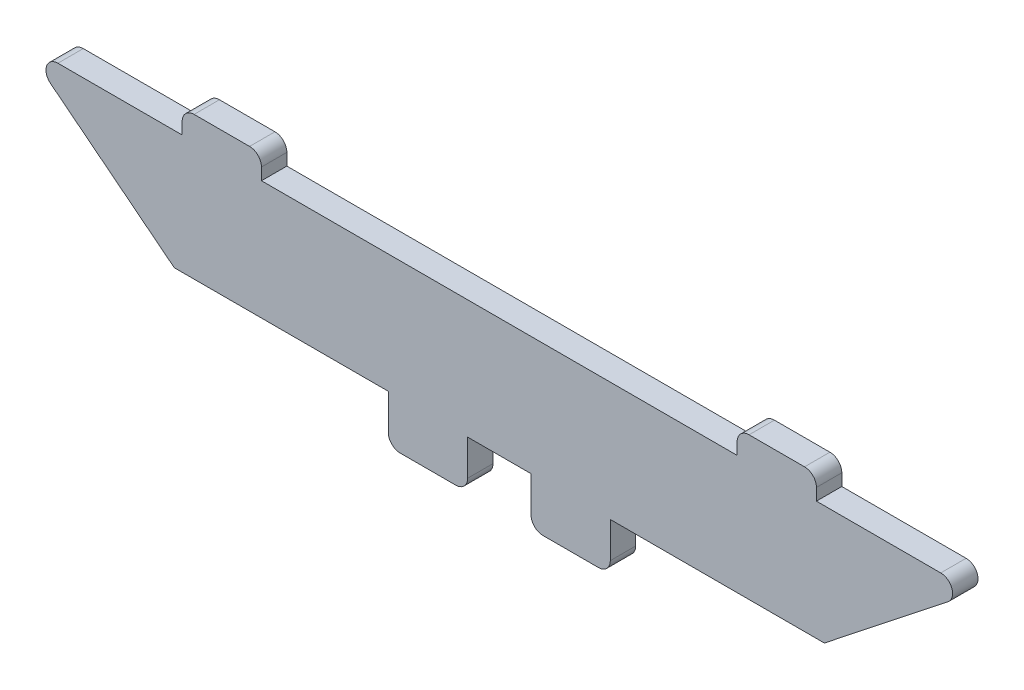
from build123d import *

# Parameters (mm, degrees)
BOSS_EXTRU_1_DEPTH = 3.2
CONG_1_R           = 1.5
CONG_2_R           = 1.5


with BuildPart() as part:
    # Esquisse1 → Boss.-Extru.1 (new body)
    with BuildSketch(Plane.XY):
        Polygon((-41, 0), (-14, 0), (-14, -6), (-4, -6), (-4, 0), (4, 0), (4, -6), (14, -6), (14, 0), (41, 0), (60, 15), (40, 15), (40, 18), (30, 18), (30, 15), (-30, 15), (-30, 18), (-40, 18), (-40, 15), (-60, 15), align=None)
    extrude(amount=BOSS_EXTRU_1_DEPTH)

    # Cong_1
    cong_1_edges = [part.edges().sort_by_distance(p)[0] for p in [
        (-40, 18, 1.6),
        (-30, 18, 1.6),
        (30, 18, 1.6),
        (40, 18, 1.6),
        (14, -6, 1.6),
        (4, -6, 1.6),
        (-4, -6, 1.6),
        (-14, -6, 1.6),
    ]]
    fillet(cong_1_edges, radius=CONG_1_R)

    # Cong_2
    cong_2_edges = [part.edges().sort_by_distance(p)[0] for p in [
        (-60, 15, 1.6),
        (60, 15, 1.6),
    ]]
    fillet(cong_2_edges, radius=CONG_2_R)


solid = part.part
